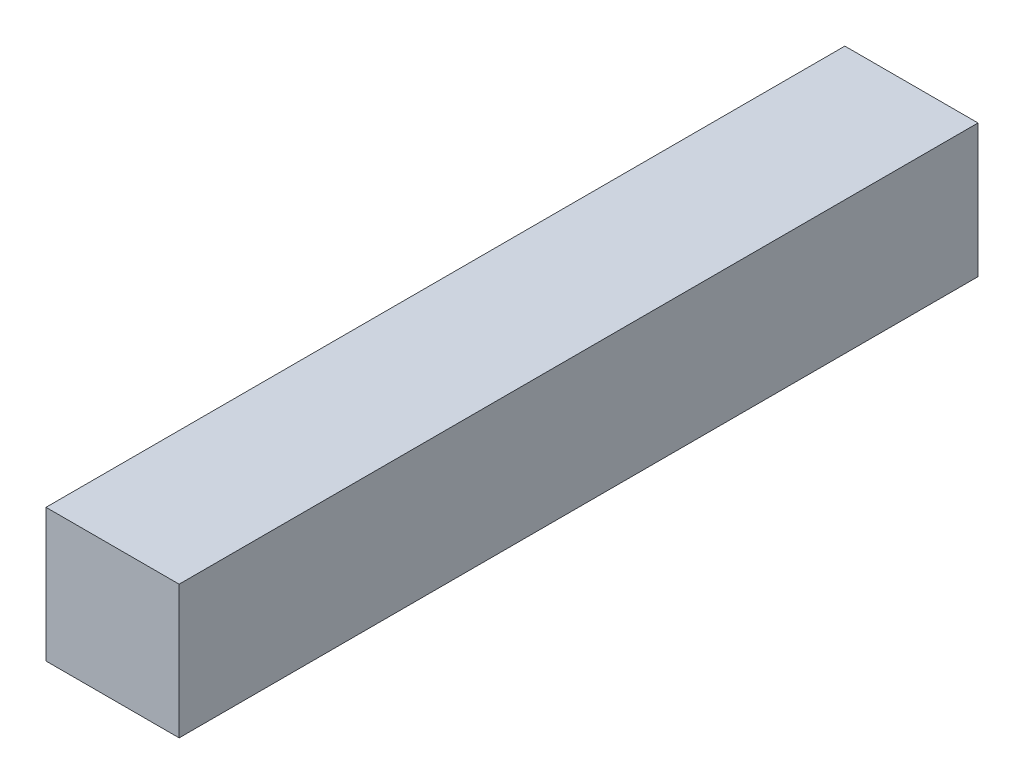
ISO-10303-21;
HEADER;
FILE_DESCRIPTION(('STEP AP214'),'2;1');
FILE_NAME('part.step','',(''),(''),'','','');
FILE_SCHEMA(('AUTOMOTIVE_DESIGN { 1 0 10303 214 1 1 1 1 }'));
ENDSEC;
DATA;
#1=APPLICATION_CONTEXT('core data for automotive mechanical design processes');
#2=APPLICATION_PROTOCOL_DEFINITION('international standard','automotive_design',2000,#1);
#3=PRODUCT_CONTEXT('',#1,'mechanical');
#4=PRODUCT('Part','Part','',(#3));
#5=PRODUCT_RELATED_PRODUCT_CATEGORY('part','',(#4));
#6=PRODUCT_DEFINITION_FORMATION('','',#4);
#7=PRODUCT_DEFINITION_CONTEXT('part definition',#1,'design');
#8=PRODUCT_DEFINITION('design','',#6,#7);
#9=PRODUCT_DEFINITION_SHAPE('','',#8);
#10=(LENGTH_UNIT() NAMED_UNIT(*) SI_UNIT(.MILLI.,.METRE.));
#11=(NAMED_UNIT(*) PLANE_ANGLE_UNIT() SI_UNIT($,.RADIAN.));
#12=(NAMED_UNIT(*) SI_UNIT($,.STERADIAN.) SOLID_ANGLE_UNIT());
#13=UNCERTAINTY_MEASURE_WITH_UNIT(LENGTH_MEASURE(1.E-05),#10,'distance_accuracy_value','');
#14=(GEOMETRIC_REPRESENTATION_CONTEXT(3) GLOBAL_UNCERTAINTY_ASSIGNED_CONTEXT((#13)) GLOBAL_UNIT_ASSIGNED_CONTEXT((#10,
#11,#12)) REPRESENTATION_CONTEXT('',''));
#15=CARTESIAN_POINT('',(0.,0.,0.));
#16=DIRECTION('',(0.,0.,1.));
#17=DIRECTION('',(1.,0.,0.));
#18=AXIS2_PLACEMENT_3D('',#15,#16,#17);
#19=CARTESIAN_POINT('',(0.,0.,150.));
#20=DIRECTION('',(1.,0.,0.));
#21=DIRECTION('',(0.,0.,-1.));
#22=AXIS2_PLACEMENT_3D('',#19,#20,#21);
#23=PLANE('',#22);
#24=DIRECTION('',(0.,-1.,0.));
#25=VECTOR('',#24,1.);
#26=CARTESIAN_POINT('',(0.,0.,0.));
#27=LINE('',#26,#25);
#28=CARTESIAN_POINT('',(0.,25.,0.));
#29=VERTEX_POINT('',#28);
#30=CARTESIAN_POINT('',(0.,0.,0.));
#31=VERTEX_POINT('',#30);
#32=EDGE_CURVE('E70',#29,#31,#27,.T.);
#33=ORIENTED_EDGE('',*,*,#32,.T.);
#34=DIRECTION('',(0.,0.,-1.));
#35=VECTOR('',#34,1.);
#36=CARTESIAN_POINT('',(0.,0.,150.));
#37=LINE('',#36,#35);
#38=CARTESIAN_POINT('',(0.,0.,150.));
#39=VERTEX_POINT('',#38);
#40=EDGE_CURVE('E11',#39,#31,#37,.T.);
#41=ORIENTED_EDGE('',*,*,#40,.F.);
#42=DIRECTION('',(0.,-1.,0.));
#43=VECTOR('',#42,1.);
#44=CARTESIAN_POINT('',(0.,0.,150.));
#45=LINE('',#44,#43);
#46=CARTESIAN_POINT('',(0.,25.,150.));
#47=VERTEX_POINT('',#46);
#48=EDGE_CURVE('E88',#47,#39,#45,.T.);
#49=ORIENTED_EDGE('',*,*,#48,.F.);
#50=DIRECTION('',(0.,0.,-1.));
#51=VECTOR('',#50,1.);
#52=CARTESIAN_POINT('',(0.,25.,150.));
#53=LINE('',#52,#51);
#54=EDGE_CURVE('E82',#47,#29,#53,.T.);
#55=ORIENTED_EDGE('',*,*,#54,.T.);
#56=EDGE_LOOP('',(#33,#41,#49,#55));
#57=FACE_BOUND('',#56,.T.);
#58=ADVANCED_FACE('F26',(#57),#23,.F.);
#59=CARTESIAN_POINT('',(0.,0.,150.));
#60=DIRECTION('',(0.,1.,0.));
#61=DIRECTION('',(0.,0.,1.));
#62=AXIS2_PLACEMENT_3D('',#59,#60,#61);
#63=PLANE('',#62);
#64=DIRECTION('',(1.,0.,0.));
#65=VECTOR('',#64,1.);
#66=CARTESIAN_POINT('',(0.,0.,0.));
#67=LINE('',#66,#65);
#68=CARTESIAN_POINT('',(25.,0.,0.));
#69=VERTEX_POINT('',#68);
#70=EDGE_CURVE('E66',#31,#69,#67,.T.);
#71=ORIENTED_EDGE('',*,*,#70,.T.);
#72=DIRECTION('',(0.,0.,-1.));
#73=VECTOR('',#72,1.);
#74=CARTESIAN_POINT('',(25.,0.,150.));
#75=LINE('',#74,#73);
#76=CARTESIAN_POINT('',(25.,0.,150.));
#77=VERTEX_POINT('',#76);
#78=EDGE_CURVE('E33',#77,#69,#75,.T.);
#79=ORIENTED_EDGE('',*,*,#78,.F.);
#80=DIRECTION('',(1.,0.,0.));
#81=VECTOR('',#80,1.);
#82=CARTESIAN_POINT('',(0.,0.,150.));
#83=LINE('',#82,#81);
#84=EDGE_CURVE('E78',#39,#77,#83,.T.);
#85=ORIENTED_EDGE('',*,*,#84,.F.);
#86=ORIENTED_EDGE('',*,*,#40,.T.);
#87=EDGE_LOOP('',(#71,#79,#85,#86));
#88=FACE_BOUND('',#87,.T.);
#89=ADVANCED_FACE('F77',(#88),#63,.F.);
#90=CARTESIAN_POINT('',(25.,0.,150.));
#91=DIRECTION('',(-1.,0.,0.));
#92=DIRECTION('',(0.,0.,1.));
#93=AXIS2_PLACEMENT_3D('',#90,#91,#92);
#94=PLANE('',#93);
#95=DIRECTION('',(0.,1.,0.));
#96=VECTOR('',#95,1.);
#97=CARTESIAN_POINT('',(25.,0.,0.));
#98=LINE('',#97,#96);
#99=CARTESIAN_POINT('',(25.,25.,0.));
#100=VERTEX_POINT('',#99);
#101=EDGE_CURVE('E71',#69,#100,#98,.T.);
#102=ORIENTED_EDGE('',*,*,#101,.T.);
#103=DIRECTION('',(0.,0.,-1.));
#104=VECTOR('',#103,1.);
#105=CARTESIAN_POINT('',(25.,25.,150.));
#106=LINE('',#105,#104);
#107=CARTESIAN_POINT('',(25.,25.,150.));
#108=VERTEX_POINT('',#107);
#109=EDGE_CURVE('E94',#108,#100,#106,.T.);
#110=ORIENTED_EDGE('',*,*,#109,.F.);
#111=DIRECTION('',(0.,1.,0.));
#112=VECTOR('',#111,1.);
#113=CARTESIAN_POINT('',(25.,0.,150.));
#114=LINE('',#113,#112);
#115=EDGE_CURVE('E45',#77,#108,#114,.T.);
#116=ORIENTED_EDGE('',*,*,#115,.F.);
#117=ORIENTED_EDGE('',*,*,#78,.T.);
#118=EDGE_LOOP('',(#102,#110,#116,#117));
#119=FACE_BOUND('',#118,.T.);
#120=ADVANCED_FACE('F97',(#119),#94,.F.);
#121=CARTESIAN_POINT('',(0.,25.,150.));
#122=DIRECTION('',(0.,-1.,0.));
#123=DIRECTION('',(0.,0.,-1.));
#124=AXIS2_PLACEMENT_3D('',#121,#122,#123);
#125=PLANE('',#124);
#126=DIRECTION('',(-1.,0.,0.));
#127=VECTOR('',#126,1.);
#128=CARTESIAN_POINT('',(0.,25.,0.));
#129=LINE('',#128,#127);
#130=EDGE_CURVE('E86',#100,#29,#129,.T.);
#131=ORIENTED_EDGE('',*,*,#130,.T.);
#132=ORIENTED_EDGE('',*,*,#54,.F.);
#133=DIRECTION('',(-1.,0.,0.));
#134=VECTOR('',#133,1.);
#135=CARTESIAN_POINT('',(0.,25.,150.));
#136=LINE('',#135,#134);
#137=EDGE_CURVE('E40',#108,#47,#136,.T.);
#138=ORIENTED_EDGE('',*,*,#137,.F.);
#139=ORIENTED_EDGE('',*,*,#109,.T.);
#140=EDGE_LOOP('',(#131,#132,#138,#139));
#141=FACE_BOUND('',#140,.T.);
#142=ADVANCED_FACE('F99',(#141),#125,.F.);
#143=CARTESIAN_POINT('',(0.,25.,150.));
#144=DIRECTION('',(0.,0.,-1.));
#145=DIRECTION('',(-1.,0.,0.));
#146=AXIS2_PLACEMENT_3D('',#143,#144,#145);
#147=PLANE('',#146);
#148=ORIENTED_EDGE('',*,*,#48,.T.);
#149=ORIENTED_EDGE('',*,*,#84,.T.);
#150=ORIENTED_EDGE('',*,*,#115,.T.);
#151=ORIENTED_EDGE('',*,*,#137,.T.);
#152=EDGE_LOOP('',(#148,#149,#150,#151));
#153=FACE_BOUND('',#152,.T.);
#154=ADVANCED_FACE('F100',(#153),#147,.F.);
#155=CARTESIAN_POINT('',(0.,25.,0.));
#156=DIRECTION('',(0.,0.,-1.));
#157=DIRECTION('',(-1.,0.,0.));
#158=AXIS2_PLACEMENT_3D('',#155,#156,#157);
#159=PLANE('',#158);
#160=ORIENTED_EDGE('',*,*,#32,.F.);
#161=ORIENTED_EDGE('',*,*,#130,.F.);
#162=ORIENTED_EDGE('',*,*,#101,.F.);
#163=ORIENTED_EDGE('',*,*,#70,.F.);
#164=EDGE_LOOP('',(#160,#161,#162,#163));
#165=FACE_BOUND('',#164,.T.);
#166=ADVANCED_FACE('F67',(#165),#159,.T.);
#167=CLOSED_SHELL('',(#58,#89,#120,#142,#154,#166));
#168=MANIFOLD_SOLID_BREP('B2',#167);
#169=ADVANCED_BREP_SHAPE_REPRESENTATION('',(#18,#168),#14);
#170=SHAPE_DEFINITION_REPRESENTATION(#9,#169);
ENDSEC;
END-ISO-10303-21;
